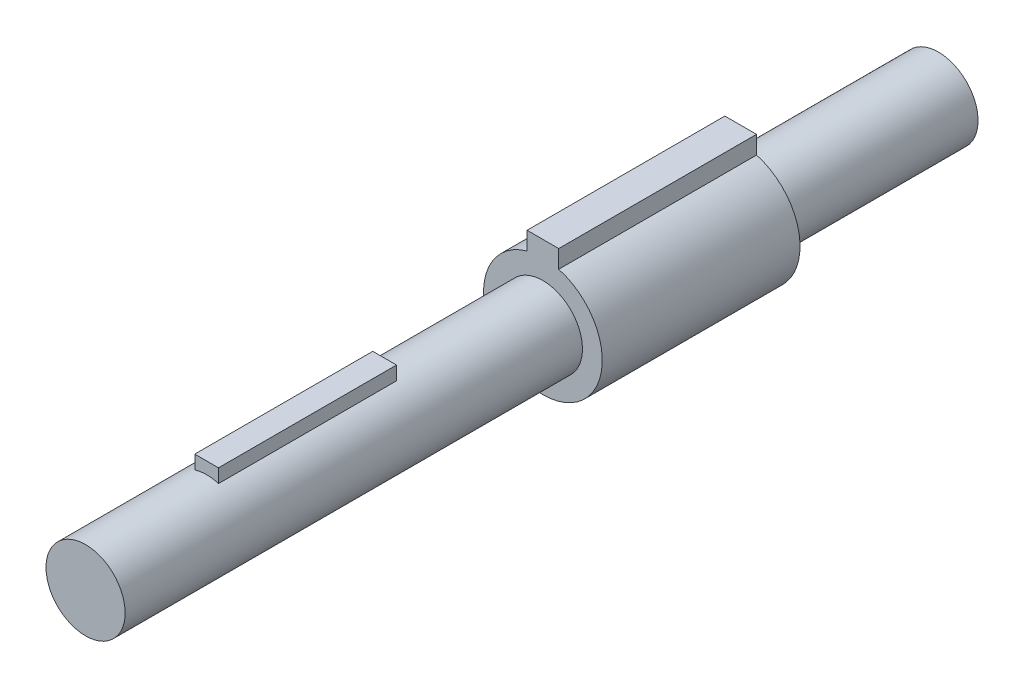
from build123d import *

# Parameters (mm, degrees)
BOSS_EXTRUDE1_DEPTH = 57.15
SKETCH3_R           = 12.7
BOSS_EXTRUDE2_DEPTH = 38.862
BOSS_EXTRUDE3_START = 50.8
SKETCH4_R           = 12.7
BOSS_EXTRUDE3_DEPTH = 50.8
BOSS_EXTRUDE4_DEPTH = 63.5
BOSS_EXTRUDE5_START = 63.5
SKETCH7_R           = 12.7
BOSS_EXTRUDE5_DEPTH = 63.5


with BuildPart() as part:
    # Sketch2 → Boss-Extrude1 (new body)
    with BuildSketch(Plane.XY):
        with BuildLine():
            Line((3.81, 16.51), (-3.81, 16.51))
            Line((-3.81, 16.51), (-3.81, 12.115027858))
            ThreePointArc((-3.81, 12.115027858), (0, -12.7), (3.81, 12.115027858))
            Line((3.81, 12.115027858), (3.81, 16.51))
        make_face()
    extrude(amount=BOSS_EXTRUDE1_DEPTH)

    # Sketch3 → Boss-Extrude2 (add)
    with BuildSketch(Plane.XY.offset(57.15)):
        with Locations(Location((0, 0, 0), (0, 0, 107.457603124))):
            Circle(SKETCH3_R)
    extrude(amount=BOSS_EXTRUDE2_DEPTH)

    # Sketch4 → Boss-Extrude3 (add)
    with BuildSketch(Plane(origin=(0, 0, 0), x_dir=(-1, 0, 0), z_dir=(0, 0, -1)).offset(BOSS_EXTRUDE3_START)):
        Circle(SKETCH4_R)
    extrude(amount=-BOSS_EXTRUDE3_DEPTH)

    # Sketch6 → Boss-Extrude4 (add)
    with BuildSketch(Plane(origin=(0, 0, -50.8), x_dir=(-1, 0, 0), z_dir=(0, 0, -1))):
        with BuildLine():
            Line((5.08, 24.13), (-5.08, 24.13))
            Line((-5.08, 24.13), (-5.08, 18.360177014))
            ThreePointArc((-5.08, 18.360177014), (0, -19.05), (5.08, 18.360177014))
            Line((5.08, 18.360177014), (5.08, 24.13))
        make_face()
    extrude(amount=BOSS_EXTRUDE4_DEPTH)

    # Sketch7 → Boss-Extrude5 (add)
    with BuildSketch(Plane(origin=(0, 0, -114.3), x_dir=(-1, 0, 0), z_dir=(0, 0, -1)).offset(BOSS_EXTRUDE5_START)):
        Circle(SKETCH7_R)
    extrude(amount=-BOSS_EXTRUDE5_DEPTH)


solid = part.part
